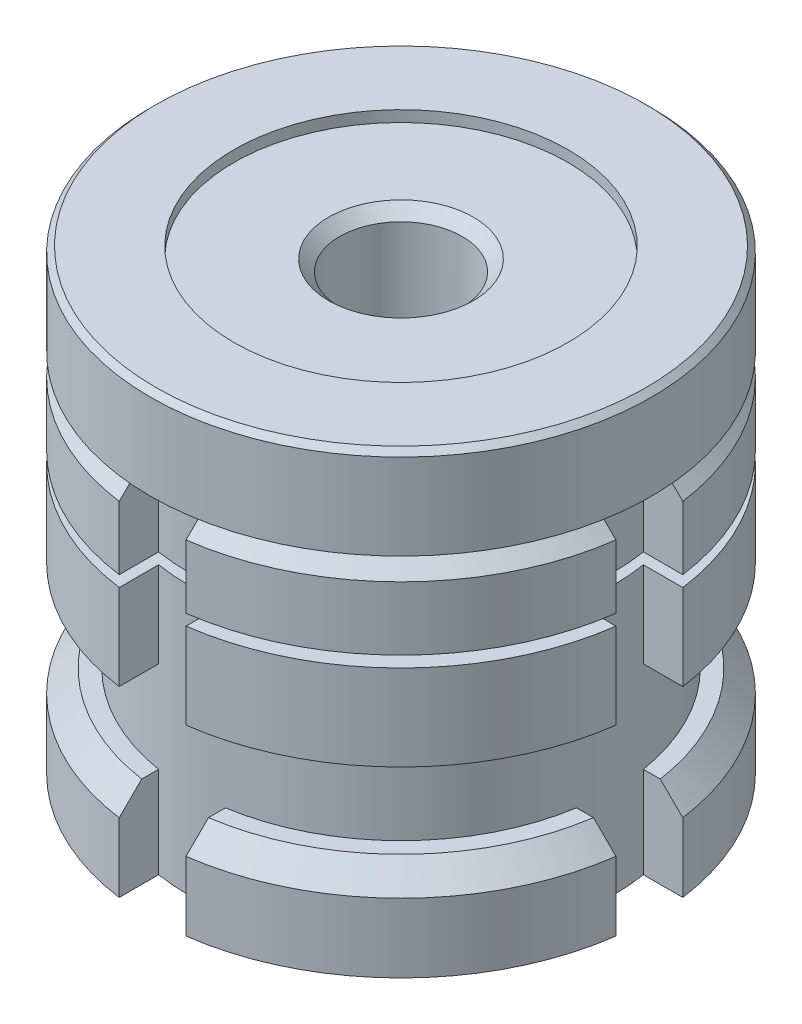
from build123d import *
from build123d.topology import SkipClean

# Parameters (mm, degrees)
SKETCH1_R           = 22.5
BOSS_EXTRUDE1_DEPTH = 16.4
SKETCH2_W           = 7.5
SKETCH2_H           = 1
SKETCH3_R           = 19
BOSS_EXTRUDE2_DEPTH = 16.4
SKETCH4_R           = 22.5
BOSS_EXTRUDE3_DEPTH = 8.2
CUT_EXTRUDE4_START  = -32.8
CUT_EXTRUDE4_DEPTH  = 32.8
CHAMFER1_SIZE       = 2
SKETCH6_R           = 22.5
BOSS_EXTRUDE4_DEPTH = 8.2
CHAMFER2_SIZE       = 0.5
CUT_EXTRUDE5_START  = -1
SKETCH7_R           = 15
CUT_EXTRUDE5_DEPTH  = 1
SKETCH8_R           = 5.5
CUT_EXTRUDE6_DEPTH  = 40
CHAMFER3_SIZE       = 1


with BuildPart() as part:
    # Sketch1 → Boss-Extrude1 (new body)
    with BuildSketch(Plane(origin=(0, 0, 0), x_dir=(1, 0, 0), z_dir=(0, 1, 0))):
        with Locations(Location((0, 0, 0), (0, 0, 270))):
            Circle(SKETCH1_R)
    extrude(amount=BOSS_EXTRUDE1_DEPTH)

    # Sketch2 → Cut-Revolve1 (revolve, cut)
    with BuildSketch(Plane(origin=(0, 0, 0), x_dir=(0, 0, -1), z_dir=(1, 0, 0))):
        with Locations((-18.75, 8.2)):
            Rectangle(SKETCH2_W, SKETCH2_H)
    revolve(axis=Axis((0, 13.26477, 0), (0, -1, 0)), mode=Mode.SUBTRACT)

    # Sketch3 → Boss-Extrude2 (add)
    with BuildSketch(Plane.XZ):
        with Locations(Location((0, 0, 0), (0, 0, 270))):
            Circle(SKETCH3_R)
    extrude(amount=BOSS_EXTRUDE2_DEPTH)

    # Sketch4 → Boss-Extrude3 (add)
    with BuildSketch(Plane.XZ.offset(16.4)):
        with Locations(Location((0, 0, 0), (0, 0, 90))):
            Circle(SKETCH4_R)
    extrude(amount=-BOSS_EXTRUDE3_DEPTH)

    # Sketch5 → Cut-Extrude4 (cut)
    with SkipClean():  # the faces are left unmerged after this step: merging them gives an invalid solid
        with BuildSketch(Plane(origin=(0, 16.4, 0), x_dir=(1, 0, 0), z_dir=(0, 1, 0)).offset(CUT_EXTRUDE4_START)):
            with BuildLine():
                Line((-22.299103, 3), (-18.761663, 3))
                ThreePointArc((-18.761663, 3), (-19, 0), (-18.761663, -3))
                Line((-18.761663, -3), (-22.299103, -3))
                ThreePointArc((-22.299103, -3), (-22.5, 0), (-22.299103, 3))
            make_face()
            with BuildLine():
                Line((-3, 22.299103), (-3, 18.761663))
                ThreePointArc((-3, 18.761663), (0, 19), (3, 18.761663))
                Line((3, 18.761663), (3, 22.299103))
                ThreePointArc((3, 22.299103), (0, 22.5), (-3, 22.299103))
            make_face()
            with BuildLine():
                Line((18.761663, 3), (22.299103, 3))
                ThreePointArc((22.299103, 3), (22.5, 0), (22.299103, -3))
                Line((22.299103, -3), (18.761663, -3))
                ThreePointArc((18.761663, -3), (19, 0), (18.761663, 3))
            make_face()
            with BuildLine():
                Line((-3, -18.761663), (-3, -22.299103))
                ThreePointArc((-3, -22.299103), (0, -22.5), (3, -22.299103))
                Line((3, -22.299103), (3, -18.761663))
                ThreePointArc((3, -18.761663), (0, -19), (-3, -18.761663))
            make_face()
        extrude(amount=CUT_EXTRUDE4_DEPTH, mode=Mode.SUBTRACT)

    # Chamfer1
    chamfer1_edges = [part.edges().sort_by_distance(p)[0] for p in [
        (15.909903, -8.2, -15.909903),
        (15.909903, -8.2, 15.909903),
        (-15.909903, -8.2, 15.909903),
        (-15.909903, -8.2, -15.909903),
        (15.909903, 16.4, 15.909903),
        (15.909903, 16.4, -15.909903),
        (-15.909903, 16.4, -15.909903),
        (-15.909903, 16.4, 15.909903),
    ]]
    chamfer(chamfer1_edges, length=CHAMFER1_SIZE)

    # Sketch6 → Boss-Extrude4 (add)
    with BuildSketch(Plane(origin=(0, 16.4, 0), x_dir=(1, 0, 0), z_dir=(0, 1, 0))):
        with Locations(Location((0, 0, 0), (0, 0, 270))):
            Circle(SKETCH6_R)
    extrude(amount=BOSS_EXTRUDE4_DEPTH)

    # Chamfer2
    chamfer2_edges = [part.edges().sort_by_distance(p)[0] for p in [
        (0, 24.6, -22.5),
    ]]
    chamfer(chamfer2_edges, length=CHAMFER2_SIZE)

    # Sketch7 → Cut-Extrude5 (cut)
    with BuildSketch(Plane(origin=(0, 24.6, 0), x_dir=(1, 0, 0), z_dir=(0, 1, 0)).offset(CUT_EXTRUDE5_START)):
        with Locations(Location((0, 0, 0), (0, 0, 270))):
            Circle(SKETCH7_R)
    extrude(amount=CUT_EXTRUDE5_DEPTH, mode=Mode.SUBTRACT)

    # Sketch8 → Cut-Extrude6 (cut)
    with BuildSketch(Plane(origin=(0, 23.6, 0), x_dir=(1, 0, 0), z_dir=(0, 1, 0))):
        with Locations(Location((0, 0, 0), (0, 0, 270))):
            Circle(SKETCH8_R)
    extrude(amount=-CUT_EXTRUDE6_DEPTH, mode=Mode.SUBTRACT)

    # Chamfer3
    chamfer3_edges = [part.edges().sort_by_distance(p)[0] for p in [
        (0, 23.6, -5.5),
        (0, -16.4, -5.5),
    ]]
    chamfer(chamfer3_edges, length=CHAMFER3_SIZE)


solid = part.part
